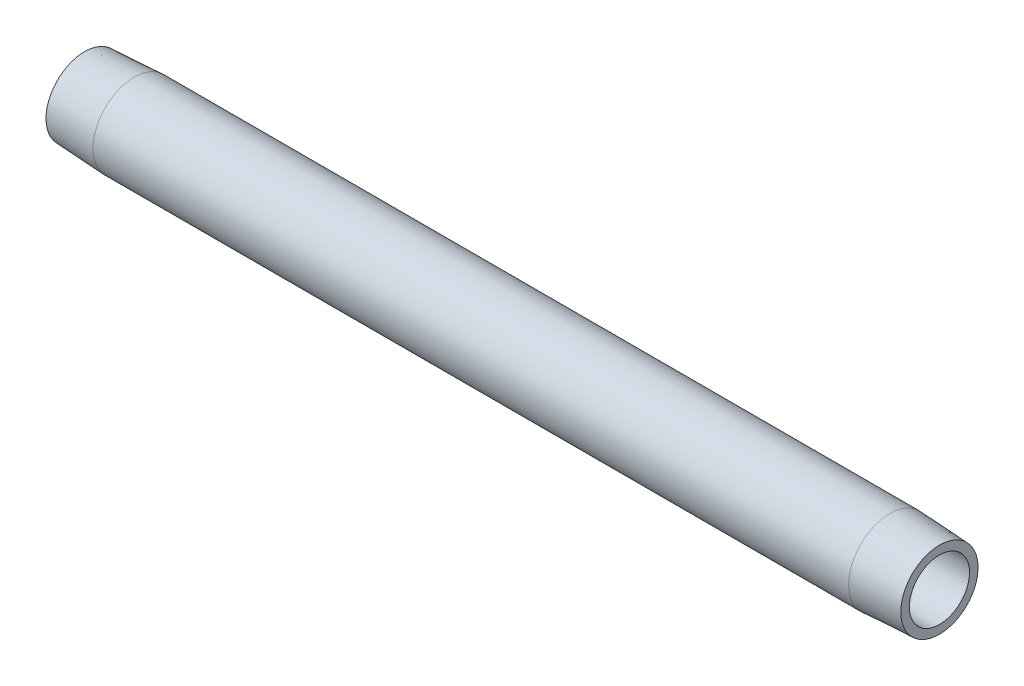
from build123d import *


with BuildPart() as part:
    # Sketch1 → Revolve1 (revolve)
    with BuildSketch(Plane.XY, mode=Mode.PRIVATE) as revolve1_sk:
        Polygon((177.8, 6.2611), (0, 6.2611), (0, 8.032050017), (10.3124, 8.5725), (167.4876, 8.5725), (177.8, 8.032050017), align=None)
    revolve(revolve1_sk.sketch.rotate(Axis((0, 0, 0), (1, 0, 0)), 90), axis=Axis((0, 0, 0), (1, 0, 0)))


solid = part.part
